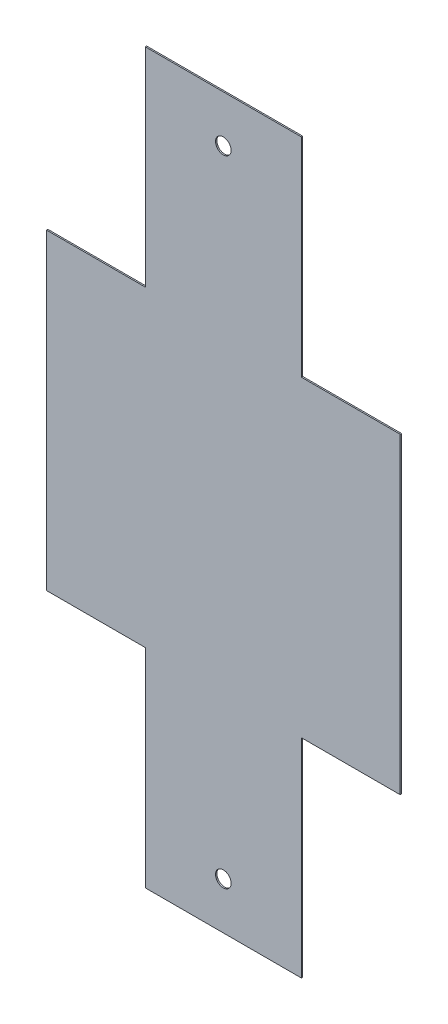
ISO-10303-21;
HEADER;
FILE_DESCRIPTION(('STEP AP214'),'2;1');
FILE_NAME('part.step','',(''),(''),'','','');
FILE_SCHEMA(('AUTOMOTIVE_DESIGN { 1 0 10303 214 1 1 1 1 }'));
ENDSEC;
DATA;
#1=APPLICATION_CONTEXT('core data for automotive mechanical design processes');
#2=APPLICATION_PROTOCOL_DEFINITION('international standard','automotive_design',2000,#1);
#3=PRODUCT_CONTEXT('',#1,'mechanical');
#4=PRODUCT('Part','Part','',(#3));
#5=PRODUCT_RELATED_PRODUCT_CATEGORY('part','',(#4));
#6=PRODUCT_DEFINITION_FORMATION('','',#4);
#7=PRODUCT_DEFINITION_CONTEXT('part definition',#1,'design');
#8=PRODUCT_DEFINITION('design','',#6,#7);
#9=PRODUCT_DEFINITION_SHAPE('','',#8);
#10=(LENGTH_UNIT() NAMED_UNIT(*) SI_UNIT(.MILLI.,.METRE.));
#11=(NAMED_UNIT(*) PLANE_ANGLE_UNIT() SI_UNIT($,.RADIAN.));
#12=(NAMED_UNIT(*) SI_UNIT($,.STERADIAN.) SOLID_ANGLE_UNIT());
#13=UNCERTAINTY_MEASURE_WITH_UNIT(LENGTH_MEASURE(1.E-05),#10,'distance_accuracy_value','');
#14=(GEOMETRIC_REPRESENTATION_CONTEXT(3) GLOBAL_UNCERTAINTY_ASSIGNED_CONTEXT((#13)) GLOBAL_UNIT_ASSIGNED_CONTEXT((#10,
#11,#12)) REPRESENTATION_CONTEXT('',''));
#15=CARTESIAN_POINT('',(0.,0.,0.));
#16=DIRECTION('',(0.,0.,1.));
#17=DIRECTION('',(1.,0.,0.));
#18=AXIS2_PLACEMENT_3D('',#15,#16,#17);
#19=CARTESIAN_POINT('',(-38.,35.,0.13));
#20=DIRECTION('',(0.,-1.,0.));
#21=DIRECTION('',(0.,0.,-1.));
#22=AXIS2_PLACEMENT_3D('',#19,#20,#21);
#23=PLANE('',#22);
#24=DIRECTION('',(-1.,0.,0.));
#25=VECTOR('',#24,1.);
#26=CARTESIAN_POINT('',(-38.,35.,0.));
#27=LINE('',#26,#25);
#28=CARTESIAN_POINT('',(7.5,35.,0.));
#29=VERTEX_POINT('',#28);
#30=CARTESIAN_POINT('',(-7.5,35.,0.));
#31=VERTEX_POINT('',#30);
#32=EDGE_CURVE('E150',#29,#31,#27,.T.);
#33=ORIENTED_EDGE('',*,*,#32,.T.);
#34=DIRECTION('',(0.,0.,1.));
#35=VECTOR('',#34,1.);
#36=CARTESIAN_POINT('',(-7.5,35.,0.));
#37=LINE('',#36,#35);
#38=CARTESIAN_POINT('',(-7.5,35.,0.13));
#39=VERTEX_POINT('',#38);
#40=EDGE_CURVE('E154',#31,#39,#37,.T.);
#41=ORIENTED_EDGE('',*,*,#40,.T.);
#42=DIRECTION('',(-1.,0.,0.));
#43=VECTOR('',#42,1.);
#44=CARTESIAN_POINT('',(-38.,35.,0.13));
#45=LINE('',#44,#43);
#46=CARTESIAN_POINT('',(7.5,35.,0.13));
#47=VERTEX_POINT('',#46);
#48=EDGE_CURVE('E45',#47,#39,#45,.T.);
#49=ORIENTED_EDGE('',*,*,#48,.F.);
#50=DIRECTION('',(0.,0.,1.));
#51=VECTOR('',#50,1.);
#52=CARTESIAN_POINT('',(7.5,35.,0.));
#53=LINE('',#52,#51);
#54=EDGE_CURVE('E188',#29,#47,#53,.T.);
#55=ORIENTED_EDGE('',*,*,#54,.F.);
#56=EDGE_LOOP('',(#33,#41,#49,#55));
#57=FACE_BOUND('',#56,.T.);
#58=ADVANCED_FACE('F37',(#57),#23,.F.);
#59=CARTESIAN_POINT('',(-38.,-35.,0.13));
#60=DIRECTION('',(0.,1.,0.));
#61=DIRECTION('',(0.,0.,1.));
#62=AXIS2_PLACEMENT_3D('',#59,#60,#61);
#63=PLANE('',#62);
#64=DIRECTION('',(1.,0.,0.));
#65=VECTOR('',#64,1.);
#66=CARTESIAN_POINT('',(-38.,-35.,0.13));
#67=LINE('',#66,#65);
#68=CARTESIAN_POINT('',(-7.5,-35.,0.13));
#69=VERTEX_POINT('',#68);
#70=CARTESIAN_POINT('',(7.5,-35.,0.13));
#71=VERTEX_POINT('',#70);
#72=EDGE_CURVE('E11',#69,#71,#67,.T.);
#73=ORIENTED_EDGE('',*,*,#72,.F.);
#74=DIRECTION('',(0.,0.,1.));
#75=VECTOR('',#74,1.);
#76=CARTESIAN_POINT('',(-7.5,-35.,0.));
#77=LINE('',#76,#75);
#78=CARTESIAN_POINT('',(-7.5,-35.,0.));
#79=VERTEX_POINT('',#78);
#80=EDGE_CURVE('E130',#79,#69,#77,.T.);
#81=ORIENTED_EDGE('',*,*,#80,.F.);
#82=DIRECTION('',(1.,0.,0.));
#83=VECTOR('',#82,1.);
#84=CARTESIAN_POINT('',(-38.,-35.,0.));
#85=LINE('',#84,#83);
#86=CARTESIAN_POINT('',(7.5,-35.,0.));
#87=VERTEX_POINT('',#86);
#88=EDGE_CURVE('E40',#79,#87,#85,.T.);
#89=ORIENTED_EDGE('',*,*,#88,.T.);
#90=DIRECTION('',(0.,0.,1.));
#91=VECTOR('',#90,1.);
#92=CARTESIAN_POINT('',(7.5,-35.,0.));
#93=LINE('',#92,#91);
#94=EDGE_CURVE('E190',#87,#71,#93,.T.);
#95=ORIENTED_EDGE('',*,*,#94,.T.);
#96=EDGE_LOOP('',(#73,#81,#89,#95));
#97=FACE_BOUND('',#96,.T.);
#98=ADVANCED_FACE('F140',(#97),#63,.F.);
#99=CARTESIAN_POINT('',(0.,0.,0.13));
#100=DIRECTION('',(0.,0.,1.));
#101=DIRECTION('',(1.,0.,0.));
#102=AXIS2_PLACEMENT_3D('',#99,#100,#101);
#103=PLANE('',#102);
#104=CARTESIAN_POINT('',(0.,30.5,0.13));
#105=DIRECTION('',(0.,0.,1.));
#106=DIRECTION('',(1.,0.,0.));
#107=AXIS2_PLACEMENT_3D('',#104,#105,#106);
#108=CIRCLE('',#107,0.75);
#109=CARTESIAN_POINT('',(0.75,30.5,0.13));
#110=VERTEX_POINT('',#109);
#111=EDGE_CURVE('E228',#110,#110,#108,.T.);
#112=ORIENTED_EDGE('',*,*,#111,.F.);
#113=EDGE_LOOP('',(#112));
#114=FACE_BOUND('',#113,.T.);
#115=CARTESIAN_POINT('',(0.,-30.5,0.13));
#116=DIRECTION('',(0.,0.,1.));
#117=DIRECTION('',(-1.,0.,0.));
#118=AXIS2_PLACEMENT_3D('',#115,#116,#117);
#119=CIRCLE('',#118,0.75);
#120=CARTESIAN_POINT('',(-0.749999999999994,-30.5,0.13));
#121=VERTEX_POINT('',#120);
#122=EDGE_CURVE('E225',#121,#121,#119,.T.);
#123=ORIENTED_EDGE('',*,*,#122,.F.);
#124=EDGE_LOOP('',(#123));
#125=FACE_BOUND('',#124,.T.);
#126=DIRECTION('',(0.,1.,0.));
#127=VECTOR('',#126,1.);
#128=CARTESIAN_POINT('',(-7.5,35.,0.13));
#129=LINE('',#128,#127);
#130=CARTESIAN_POINT('',(-7.5,15.,0.13));
#131=VERTEX_POINT('',#130);
#132=EDGE_CURVE('E135',#131,#39,#129,.T.);
#133=ORIENTED_EDGE('',*,*,#132,.F.);
#134=DIRECTION('',(1.,0.,0.));
#135=VECTOR('',#134,1.);
#136=CARTESIAN_POINT('',(-17.,15.,0.13));
#137=LINE('',#136,#135);
#138=CARTESIAN_POINT('',(-17.,15.,0.13));
#139=VERTEX_POINT('',#138);
#140=EDGE_CURVE('E207',#139,#131,#137,.T.);
#141=ORIENTED_EDGE('',*,*,#140,.F.);
#142=DIRECTION('',(0.,1.,0.));
#143=VECTOR('',#142,1.);
#144=CARTESIAN_POINT('',(-17.,-15.,0.13));
#145=LINE('',#144,#143);
#146=CARTESIAN_POINT('',(-17.,-15.,0.13));
#147=VERTEX_POINT('',#146);
#148=EDGE_CURVE('E210',#147,#139,#145,.T.);
#149=ORIENTED_EDGE('',*,*,#148,.F.);
#150=DIRECTION('',(-1.,0.,0.));
#151=VECTOR('',#150,1.);
#152=CARTESIAN_POINT('',(-17.,-15.,0.13));
#153=LINE('',#152,#151);
#154=CARTESIAN_POINT('',(-7.5,-15.,0.13));
#155=VERTEX_POINT('',#154);
#156=EDGE_CURVE('E213',#155,#147,#153,.T.);
#157=ORIENTED_EDGE('',*,*,#156,.F.);
#158=DIRECTION('',(0.,1.,0.));
#159=VECTOR('',#158,1.);
#160=CARTESIAN_POINT('',(-7.5,-35.,0.13));
#161=LINE('',#160,#159);
#162=EDGE_CURVE('E177',#69,#155,#161,.T.);
#163=ORIENTED_EDGE('',*,*,#162,.F.);
#164=ORIENTED_EDGE('',*,*,#72,.T.);
#165=DIRECTION('',(0.,-1.,0.));
#166=VECTOR('',#165,1.);
#167=CARTESIAN_POINT('',(7.5,-35.,0.13));
#168=LINE('',#167,#166);
#169=CARTESIAN_POINT('',(7.5,-15.,0.13));
#170=VERTEX_POINT('',#169);
#171=EDGE_CURVE('E165',#170,#71,#168,.T.);
#172=ORIENTED_EDGE('',*,*,#171,.F.);
#173=DIRECTION('',(-1.,0.,0.));
#174=VECTOR('',#173,1.);
#175=CARTESIAN_POINT('',(17.,-15.,0.13));
#176=LINE('',#175,#174);
#177=CARTESIAN_POINT('',(17.,-15.,0.13));
#178=VERTEX_POINT('',#177);
#179=EDGE_CURVE('E184',#178,#170,#176,.T.);
#180=ORIENTED_EDGE('',*,*,#179,.F.);
#181=DIRECTION('',(0.,-1.,0.));
#182=VECTOR('',#181,1.);
#183=CARTESIAN_POINT('',(17.,-15.,0.13));
#184=LINE('',#183,#182);
#185=CARTESIAN_POINT('',(17.,15.,0.13));
#186=VERTEX_POINT('',#185);
#187=EDGE_CURVE('E181',#186,#178,#184,.T.);
#188=ORIENTED_EDGE('',*,*,#187,.F.);
#189=DIRECTION('',(1.,0.,0.));
#190=VECTOR('',#189,1.);
#191=CARTESIAN_POINT('',(17.,15.,0.13));
#192=LINE('',#191,#190);
#193=CARTESIAN_POINT('',(7.5,15.,0.13));
#194=VERTEX_POINT('',#193);
#195=EDGE_CURVE('E178',#194,#186,#192,.T.);
#196=ORIENTED_EDGE('',*,*,#195,.F.);
#197=DIRECTION('',(0.,-1.,0.));
#198=VECTOR('',#197,1.);
#199=CARTESIAN_POINT('',(7.5,35.,0.13));
#200=LINE('',#199,#198);
#201=EDGE_CURVE('E174',#47,#194,#200,.T.);
#202=ORIENTED_EDGE('',*,*,#201,.F.);
#203=ORIENTED_EDGE('',*,*,#48,.T.);
#204=EDGE_LOOP('',(#133,#141,#149,#157,#163,#164,#172,#180,#188,#196,#202,#203));
#205=FACE_BOUND('',#204,.T.);
#206=ADVANCED_FACE('F240',(#114,#125,#205),#103,.T.);
#207=CARTESIAN_POINT('',(0.,0.,0.));
#208=DIRECTION('',(0.,0.,1.));
#209=DIRECTION('',(1.,0.,0.));
#210=AXIS2_PLACEMENT_3D('',#207,#208,#209);
#211=PLANE('',#210);
#212=CARTESIAN_POINT('',(0.,30.5,0.));
#213=DIRECTION('',(0.,0.,1.));
#214=DIRECTION('',(1.,0.,0.));
#215=AXIS2_PLACEMENT_3D('',#212,#213,#214);
#216=CIRCLE('',#215,0.75);
#217=CARTESIAN_POINT('',(0.75,30.5,0.));
#218=VERTEX_POINT('',#217);
#219=EDGE_CURVE('E191',#218,#218,#216,.F.);
#220=ORIENTED_EDGE('',*,*,#219,.F.);
#221=EDGE_LOOP('',(#220));
#222=FACE_BOUND('',#221,.T.);
#223=CARTESIAN_POINT('',(0.,-30.5,0.));
#224=DIRECTION('',(0.,0.,1.));
#225=DIRECTION('',(1.,0.,0.));
#226=AXIS2_PLACEMENT_3D('',#223,#224,#225);
#227=CIRCLE('',#226,0.75);
#228=CARTESIAN_POINT('',(0.750000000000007,-30.5,0.));
#229=VERTEX_POINT('',#228);
#230=EDGE_CURVE('E229',#229,#229,#227,.F.);
#231=ORIENTED_EDGE('',*,*,#230,.F.);
#232=EDGE_LOOP('',(#231));
#233=FACE_BOUND('',#232,.T.);
#234=DIRECTION('',(1.,0.,0.));
#235=VECTOR('',#234,1.);
#236=CARTESIAN_POINT('',(-17.,15.,0.));
#237=LINE('',#236,#235);
#238=CARTESIAN_POINT('',(-17.,15.,0.));
#239=VERTEX_POINT('',#238);
#240=CARTESIAN_POINT('',(-7.5,15.,0.));
#241=VERTEX_POINT('',#240);
#242=EDGE_CURVE('E219',#239,#241,#237,.T.);
#243=ORIENTED_EDGE('',*,*,#242,.T.);
#244=DIRECTION('',(0.,1.,0.));
#245=VECTOR('',#244,1.);
#246=CARTESIAN_POINT('',(-7.5,35.,0.));
#247=LINE('',#246,#245);
#248=EDGE_CURVE('E142',#241,#31,#247,.T.);
#249=ORIENTED_EDGE('',*,*,#248,.T.);
#250=ORIENTED_EDGE('',*,*,#32,.F.);
#251=DIRECTION('',(0.,-1.,0.));
#252=VECTOR('',#251,1.);
#253=CARTESIAN_POINT('',(7.5,35.,0.));
#254=LINE('',#253,#252);
#255=CARTESIAN_POINT('',(7.5,15.,0.));
#256=VERTEX_POINT('',#255);
#257=EDGE_CURVE('E162',#29,#256,#254,.T.);
#258=ORIENTED_EDGE('',*,*,#257,.T.);
#259=DIRECTION('',(1.,0.,0.));
#260=VECTOR('',#259,1.);
#261=CARTESIAN_POINT('',(17.,15.,0.));
#262=LINE('',#261,#260);
#263=CARTESIAN_POINT('',(17.,15.,0.));
#264=VERTEX_POINT('',#263);
#265=EDGE_CURVE('E166',#256,#264,#262,.T.);
#266=ORIENTED_EDGE('',*,*,#265,.T.);
#267=DIRECTION('',(0.,-1.,0.));
#268=VECTOR('',#267,1.);
#269=CARTESIAN_POINT('',(17.,-15.,0.));
#270=LINE('',#269,#268);
#271=CARTESIAN_POINT('',(17.,-15.,0.));
#272=VERTEX_POINT('',#271);
#273=EDGE_CURVE('E61',#264,#272,#270,.T.);
#274=ORIENTED_EDGE('',*,*,#273,.T.);
#275=DIRECTION('',(-1.,0.,0.));
#276=VECTOR('',#275,1.);
#277=CARTESIAN_POINT('',(17.,-15.,0.));
#278=LINE('',#277,#276);
#279=CARTESIAN_POINT('',(7.5,-15.,0.));
#280=VERTEX_POINT('',#279);
#281=EDGE_CURVE('E170',#272,#280,#278,.T.);
#282=ORIENTED_EDGE('',*,*,#281,.T.);
#283=DIRECTION('',(0.,-1.,0.));
#284=VECTOR('',#283,1.);
#285=CARTESIAN_POINT('',(7.5,-35.,0.));
#286=LINE('',#285,#284);
#287=EDGE_CURVE('E149',#280,#87,#286,.T.);
#288=ORIENTED_EDGE('',*,*,#287,.T.);
#289=ORIENTED_EDGE('',*,*,#88,.F.);
#290=DIRECTION('',(0.,1.,0.));
#291=VECTOR('',#290,1.);
#292=CARTESIAN_POINT('',(-7.5,-35.,0.));
#293=LINE('',#292,#291);
#294=CARTESIAN_POINT('',(-7.5,-15.,0.));
#295=VERTEX_POINT('',#294);
#296=EDGE_CURVE('E126',#79,#295,#293,.T.);
#297=ORIENTED_EDGE('',*,*,#296,.T.);
#298=DIRECTION('',(-1.,0.,0.));
#299=VECTOR('',#298,1.);
#300=CARTESIAN_POINT('',(-17.,-15.,0.));
#301=LINE('',#300,#299);
#302=CARTESIAN_POINT('',(-17.,-15.,0.));
#303=VERTEX_POINT('',#302);
#304=EDGE_CURVE('E53',#295,#303,#301,.T.);
#305=ORIENTED_EDGE('',*,*,#304,.T.);
#306=DIRECTION('',(0.,1.,0.));
#307=VECTOR('',#306,1.);
#308=CARTESIAN_POINT('',(-17.,-15.,0.));
#309=LINE('',#308,#307);
#310=EDGE_CURVE('E221',#303,#239,#309,.T.);
#311=ORIENTED_EDGE('',*,*,#310,.T.);
#312=EDGE_LOOP('',(#243,#249,#250,#258,#266,#274,#282,#288,#289,#297,#305,#311));
#313=FACE_BOUND('',#312,.T.);
#314=ADVANCED_FACE('F146',(#222,#233,#313),#211,.F.);
#315=CARTESIAN_POINT('',(7.5,35.,0.));
#316=DIRECTION('',(-1.,0.,0.));
#317=DIRECTION('',(0.,-1.,0.));
#318=AXIS2_PLACEMENT_3D('',#315,#316,#317);
#319=PLANE('',#318);
#320=ORIENTED_EDGE('',*,*,#201,.T.);
#321=DIRECTION('',(0.,0.,1.));
#322=VECTOR('',#321,1.);
#323=CARTESIAN_POINT('',(7.5,15.,0.));
#324=LINE('',#323,#322);
#325=EDGE_CURVE('E173',#256,#194,#324,.T.);
#326=ORIENTED_EDGE('',*,*,#325,.F.);
#327=ORIENTED_EDGE('',*,*,#257,.F.);
#328=ORIENTED_EDGE('',*,*,#54,.T.);
#329=EDGE_LOOP('',(#320,#326,#327,#328));
#330=FACE_BOUND('',#329,.T.);
#331=ADVANCED_FACE('F281',(#330),#319,.F.);
#332=CARTESIAN_POINT('',(7.5,-35.,0.));
#333=DIRECTION('',(-1.,0.,0.));
#334=DIRECTION('',(0.,-1.,0.));
#335=AXIS2_PLACEMENT_3D('',#332,#333,#334);
#336=PLANE('',#335);
#337=ORIENTED_EDGE('',*,*,#171,.T.);
#338=ORIENTED_EDGE('',*,*,#94,.F.);
#339=ORIENTED_EDGE('',*,*,#287,.F.);
#340=DIRECTION('',(0.,0.,1.));
#341=VECTOR('',#340,1.);
#342=CARTESIAN_POINT('',(7.5,-15.,0.));
#343=LINE('',#342,#341);
#344=EDGE_CURVE('E193',#280,#170,#343,.T.);
#345=ORIENTED_EDGE('',*,*,#344,.T.);
#346=EDGE_LOOP('',(#337,#338,#339,#345));
#347=FACE_BOUND('',#346,.T.);
#348=ADVANCED_FACE('F284',(#347),#336,.F.);
#349=CARTESIAN_POINT('',(17.,-15.,0.));
#350=DIRECTION('',(0.,1.,0.));
#351=DIRECTION('',(0.,0.,1.));
#352=AXIS2_PLACEMENT_3D('',#349,#350,#351);
#353=PLANE('',#352);
#354=ORIENTED_EDGE('',*,*,#179,.T.);
#355=ORIENTED_EDGE('',*,*,#344,.F.);
#356=ORIENTED_EDGE('',*,*,#281,.F.);
#357=DIRECTION('',(0.,0.,1.));
#358=VECTOR('',#357,1.);
#359=CARTESIAN_POINT('',(17.,-15.,0.));
#360=LINE('',#359,#358);
#361=EDGE_CURVE('E195',#272,#178,#360,.T.);
#362=ORIENTED_EDGE('',*,*,#361,.T.);
#363=EDGE_LOOP('',(#354,#355,#356,#362));
#364=FACE_BOUND('',#363,.T.);
#365=ADVANCED_FACE('F287',(#364),#353,.F.);
#366=CARTESIAN_POINT('',(17.,-15.,0.));
#367=DIRECTION('',(-1.,0.,0.));
#368=DIRECTION('',(0.,-1.,0.));
#369=AXIS2_PLACEMENT_3D('',#366,#367,#368);
#370=PLANE('',#369);
#371=ORIENTED_EDGE('',*,*,#187,.T.);
#372=ORIENTED_EDGE('',*,*,#361,.F.);
#373=ORIENTED_EDGE('',*,*,#273,.F.);
#374=DIRECTION('',(0.,0.,1.));
#375=VECTOR('',#374,1.);
#376=CARTESIAN_POINT('',(17.,15.,0.));
#377=LINE('',#376,#375);
#378=EDGE_CURVE('E197',#264,#186,#377,.T.);
#379=ORIENTED_EDGE('',*,*,#378,.T.);
#380=EDGE_LOOP('',(#371,#372,#373,#379));
#381=FACE_BOUND('',#380,.T.);
#382=ADVANCED_FACE('F291',(#381),#370,.F.);
#383=CARTESIAN_POINT('',(17.,15.,0.));
#384=DIRECTION('',(0.,-1.,0.));
#385=DIRECTION('',(1.,0.,0.));
#386=AXIS2_PLACEMENT_3D('',#383,#384,#385);
#387=PLANE('',#386);
#388=ORIENTED_EDGE('',*,*,#195,.T.);
#389=ORIENTED_EDGE('',*,*,#378,.F.);
#390=ORIENTED_EDGE('',*,*,#265,.F.);
#391=ORIENTED_EDGE('',*,*,#325,.T.);
#392=EDGE_LOOP('',(#388,#389,#390,#391));
#393=FACE_BOUND('',#392,.T.);
#394=ADVANCED_FACE('F295',(#393),#387,.F.);
#395=CARTESIAN_POINT('',(-7.5,35.,0.));
#396=DIRECTION('',(1.,0.,0.));
#397=DIRECTION('',(0.,1.,0.));
#398=AXIS2_PLACEMENT_3D('',#395,#396,#397);
#399=PLANE('',#398);
#400=ORIENTED_EDGE('',*,*,#132,.T.);
#401=ORIENTED_EDGE('',*,*,#40,.F.);
#402=ORIENTED_EDGE('',*,*,#248,.F.);
#403=DIRECTION('',(0.,0.,1.));
#404=VECTOR('',#403,1.);
#405=CARTESIAN_POINT('',(-7.5,15.,0.));
#406=LINE('',#405,#404);
#407=EDGE_CURVE('E159',#241,#131,#406,.T.);
#408=ORIENTED_EDGE('',*,*,#407,.T.);
#409=EDGE_LOOP('',(#400,#401,#402,#408));
#410=FACE_BOUND('',#409,.T.);
#411=ADVANCED_FACE('F252',(#410),#399,.F.);
#412=CARTESIAN_POINT('',(-17.,15.,0.));
#413=DIRECTION('',(0.,-1.,0.));
#414=DIRECTION('',(1.,0.,0.));
#415=AXIS2_PLACEMENT_3D('',#412,#413,#414);
#416=PLANE('',#415);
#417=ORIENTED_EDGE('',*,*,#140,.T.);
#418=ORIENTED_EDGE('',*,*,#407,.F.);
#419=ORIENTED_EDGE('',*,*,#242,.F.);
#420=DIRECTION('',(0.,0.,1.));
#421=VECTOR('',#420,1.);
#422=CARTESIAN_POINT('',(-17.,15.,0.));
#423=LINE('',#422,#421);
#424=EDGE_CURVE('E203',#239,#139,#423,.T.);
#425=ORIENTED_EDGE('',*,*,#424,.T.);
#426=EDGE_LOOP('',(#417,#418,#419,#425));
#427=FACE_BOUND('',#426,.T.);
#428=ADVANCED_FACE('F258',(#427),#416,.F.);
#429=CARTESIAN_POINT('',(-17.,-15.,0.));
#430=DIRECTION('',(1.,0.,0.));
#431=DIRECTION('',(0.,0.,-1.));
#432=AXIS2_PLACEMENT_3D('',#429,#430,#431);
#433=PLANE('',#432);
#434=ORIENTED_EDGE('',*,*,#148,.T.);
#435=ORIENTED_EDGE('',*,*,#424,.F.);
#436=ORIENTED_EDGE('',*,*,#310,.F.);
#437=DIRECTION('',(0.,0.,1.));
#438=VECTOR('',#437,1.);
#439=CARTESIAN_POINT('',(-17.,-15.,0.));
#440=LINE('',#439,#438);
#441=EDGE_CURVE('E201',#303,#147,#440,.T.);
#442=ORIENTED_EDGE('',*,*,#441,.T.);
#443=EDGE_LOOP('',(#434,#435,#436,#442));
#444=FACE_BOUND('',#443,.T.);
#445=ADVANCED_FACE('F260',(#444),#433,.F.);
#446=CARTESIAN_POINT('',(-17.,-15.,0.));
#447=DIRECTION('',(0.,1.,0.));
#448=DIRECTION('',(-1.,0.,0.));
#449=AXIS2_PLACEMENT_3D('',#446,#447,#448);
#450=PLANE('',#449);
#451=ORIENTED_EDGE('',*,*,#156,.T.);
#452=ORIENTED_EDGE('',*,*,#441,.F.);
#453=ORIENTED_EDGE('',*,*,#304,.F.);
#454=DIRECTION('',(0.,0.,1.));
#455=VECTOR('',#454,1.);
#456=CARTESIAN_POINT('',(-7.5,-15.,0.));
#457=LINE('',#456,#455);
#458=EDGE_CURVE('E132',#295,#155,#457,.T.);
#459=ORIENTED_EDGE('',*,*,#458,.T.);
#460=EDGE_LOOP('',(#451,#452,#453,#459));
#461=FACE_BOUND('',#460,.T.);
#462=ADVANCED_FACE('F262',(#461),#450,.F.);
#463=CARTESIAN_POINT('',(-7.5,-35.,0.));
#464=DIRECTION('',(1.,0.,0.));
#465=DIRECTION('',(0.,1.,0.));
#466=AXIS2_PLACEMENT_3D('',#463,#464,#465);
#467=PLANE('',#466);
#468=ORIENTED_EDGE('',*,*,#162,.T.);
#469=ORIENTED_EDGE('',*,*,#458,.F.);
#470=ORIENTED_EDGE('',*,*,#296,.F.);
#471=ORIENTED_EDGE('',*,*,#80,.T.);
#472=EDGE_LOOP('',(#468,#469,#470,#471));
#473=FACE_BOUND('',#472,.T.);
#474=ADVANCED_FACE('F129',(#473),#467,.F.);
#475=CARTESIAN_POINT('',(0.,-30.5,-0.000999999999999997));
#476=DIRECTION('',(0.,0.,1.));
#477=DIRECTION('',(1.,0.,0.));
#478=AXIS2_PLACEMENT_3D('',#475,#476,#477);
#479=CYLINDRICAL_SURFACE('',#478,0.75);
#480=ORIENTED_EDGE('',*,*,#122,.T.);
#481=EDGE_LOOP('',(#480));
#482=FACE_BOUND('',#481,.T.);
#483=ORIENTED_EDGE('',*,*,#230,.T.);
#484=EDGE_LOOP('',(#483));
#485=FACE_BOUND('',#484,.T.);
#486=ADVANCED_FACE('F269',(#482,#485),#479,.F.);
#487=CARTESIAN_POINT('',(0.,30.5,-0.000999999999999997));
#488=DIRECTION('',(0.,0.,1.));
#489=DIRECTION('',(1.,0.,0.));
#490=AXIS2_PLACEMENT_3D('',#487,#488,#489);
#491=CYLINDRICAL_SURFACE('',#490,0.75);
#492=ORIENTED_EDGE('',*,*,#111,.T.);
#493=EDGE_LOOP('',(#492));
#494=FACE_BOUND('',#493,.T.);
#495=ORIENTED_EDGE('',*,*,#219,.T.);
#496=EDGE_LOOP('',(#495));
#497=FACE_BOUND('',#496,.T.);
#498=ADVANCED_FACE('F237',(#494,#497),#491,.F.);
#499=CLOSED_SHELL('',(#58,#98,#206,#314,#331,#348,#365,#382,#394,#411,#428,#445,#462,#474,#486,#498));
#500=MANIFOLD_SOLID_BREP('B2',#499);
#501=ADVANCED_BREP_SHAPE_REPRESENTATION('',(#18,#500),#14);
#502=SHAPE_DEFINITION_REPRESENTATION(#9,#501);
ENDSEC;
END-ISO-10303-21;
